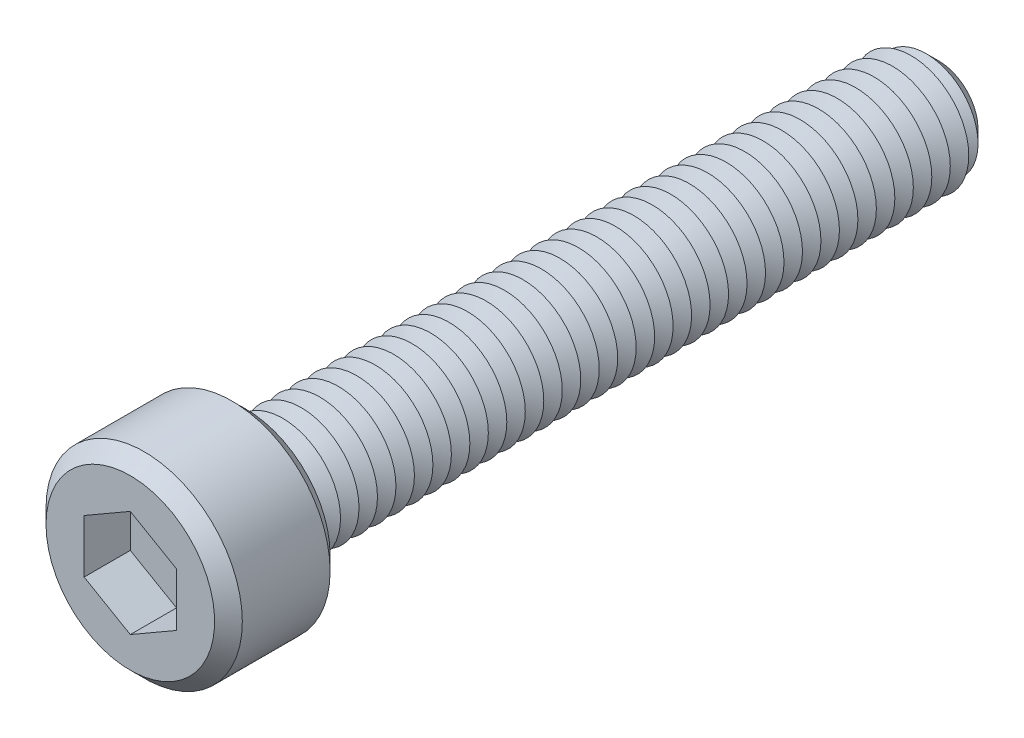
from build123d import *

# Parameters (mm, degrees)
SKETCH1_R           = 4.25
BOSS_EXTRUDE1_DEPTH = 5
SKETCH2_R           = 2.5
BOSS_EXTRUDE2_DEPTH = 30
CHAMFER1_SIZE       = 0.8
LPATTERN1_COUNT     = 37
LPATTERN1_PITCH     = 0.8
CUT_EXTRUDE1_DEPTH  = 2
SKETCH6_R           = 0.65
CUT_EXTRUDE2_DEPTH  = 33
CHAMFER2_SIZE       = 0.6


with BuildPart() as part:
    # Sketch1 → Boss-Extrude1 (new body)
    with BuildSketch(Plane.XY):
        Circle(SKETCH1_R)
    extrude(amount=BOSS_EXTRUDE1_DEPTH)

    # Sketch2 → Boss-Extrude2 (add)
    with BuildSketch(Plane(origin=(0, 0, 0), x_dir=(-1, 0, 0), z_dir=(0, 0, -1))):
        Circle(SKETCH2_R)
    extrude(amount=BOSS_EXTRUDE2_DEPTH)

    # Chamfer1
    chamfer1_edges = [part.edges().sort_by_distance(p)[0] for p in [
        (2.5, 0, -30),
    ]]
    chamfer(chamfer1_edges, length=CHAMFER1_SIZE)

    # Sketch4 → Cut-Revolve1 (revolve, cut)
    with BuildSketch(Plane(origin=(0, 0, 0), x_dir=(0, 0, -1), z_dir=(1, 0, 0)), mode=Mode.PRIVATE) as cut_revolve1_sk:
        Polygon((0, 2.5), (0.4, 1.807179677), (0.8, 2.5), align=None)
    cut_revolve1 = revolve(cut_revolve1_sk.sketch.rotate(Axis((0, 0, 2.512122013), (0, 0, -1)), 90), axis=Axis((0, 0, 2.512122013), (0, 0, -1)), mode=Mode.SUBTRACT)

    # LPattern1: Cut-Revolve1 ×37
    with Locations(*[(0, 0, -i * LPATTERN1_PITCH) for i in range(1, LPATTERN1_COUNT)]):
        add(cut_revolve1, mode=Mode.SUBTRACT)

    # Sketch5 → Cut-Extrude1 (cut)
    with BuildSketch(Plane.XY.offset(5)):
        Polygon((0, 2.309401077), (-2, 1.154700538), (-2, -1.154700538), (0, -2.309401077), (2, -1.154700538), (2, 1.154700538), align=None)
    extrude(amount=-CUT_EXTRUDE1_DEPTH, mode=Mode.SUBTRACT)

    # Sketch6 → Cut-Extrude2 (cut)
    with BuildSketch(Plane.XY.offset(3)):
        Circle(SKETCH6_R)
    extrude(amount=-CUT_EXTRUDE2_DEPTH, mode=Mode.SUBTRACT)

    # Chamfer2
    chamfer2_edges = [part.edges().sort_by_distance(p)[0] for p in [
        (-4.25, 0, 0),
        (-4.25, 0, 5),
    ]]
    chamfer(chamfer2_edges, length=CHAMFER2_SIZE)


solid = part.part
